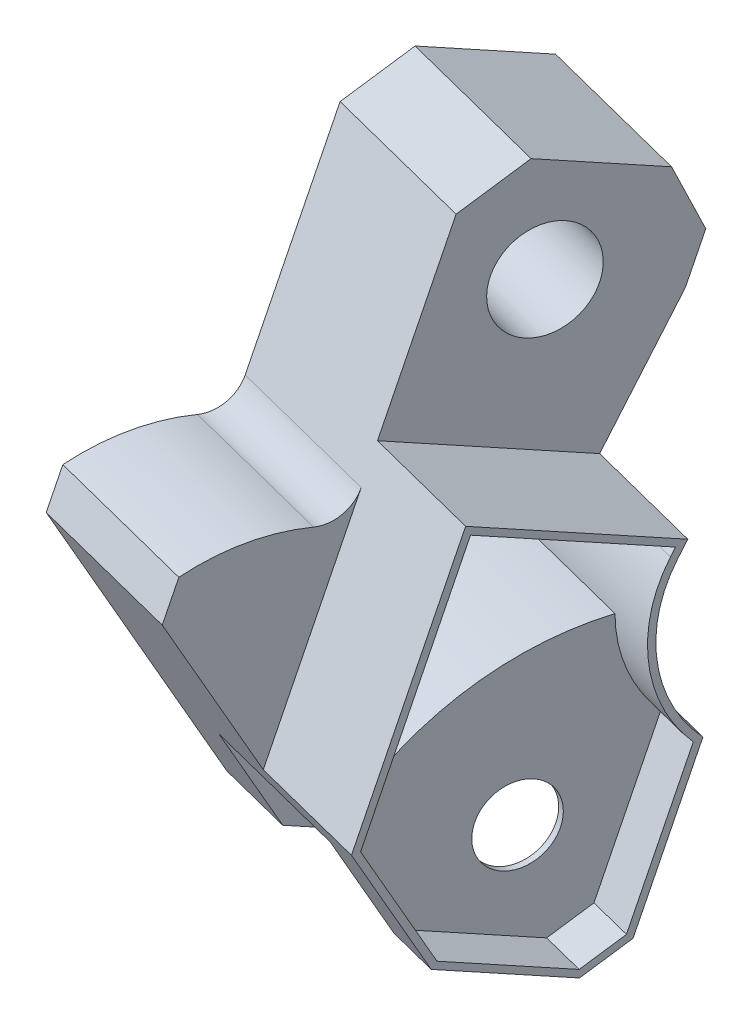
ISO-10303-21;
HEADER;
FILE_DESCRIPTION(('STEP AP214'),'2;1');
FILE_NAME('part.step','',(''),(''),'','','');
FILE_SCHEMA(('AUTOMOTIVE_DESIGN { 1 0 10303 214 1 1 1 1 }'));
ENDSEC;
DATA;
#1=APPLICATION_CONTEXT('core data for automotive mechanical design processes');
#2=APPLICATION_PROTOCOL_DEFINITION('international standard','automotive_design',2000,#1);
#3=PRODUCT_CONTEXT('',#1,'mechanical');
#4=PRODUCT('Part','Part','',(#3));
#5=PRODUCT_RELATED_PRODUCT_CATEGORY('part','',(#4));
#6=PRODUCT_DEFINITION_FORMATION('','',#4);
#7=PRODUCT_DEFINITION_CONTEXT('part definition',#1,'design');
#8=PRODUCT_DEFINITION('design','',#6,#7);
#9=PRODUCT_DEFINITION_SHAPE('','',#8);
#10=(LENGTH_UNIT() NAMED_UNIT(*) SI_UNIT(.MILLI.,.METRE.));
#11=(NAMED_UNIT(*) PLANE_ANGLE_UNIT() SI_UNIT($,.RADIAN.));
#12=(NAMED_UNIT(*) SI_UNIT($,.STERADIAN.) SOLID_ANGLE_UNIT());
#13=UNCERTAINTY_MEASURE_WITH_UNIT(LENGTH_MEASURE(1.E-05),#10,'distance_accuracy_value','');
#14=(GEOMETRIC_REPRESENTATION_CONTEXT(3) GLOBAL_UNCERTAINTY_ASSIGNED_CONTEXT((#13)) GLOBAL_UNIT_ASSIGNED_CONTEXT((#10,
#11,#12)) REPRESENTATION_CONTEXT('',''));
#15=CARTESIAN_POINT('',(0.,0.,0.));
#16=DIRECTION('',(0.,0.,1.));
#17=DIRECTION('',(1.,0.,0.));
#18=AXIS2_PLACEMENT_3D('',#15,#16,#17);
#19=CARTESIAN_POINT('',(38.7003994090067,-81.1170854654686,36.3083672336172));
#20=DIRECTION('',(0.224295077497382,0.466720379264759,-0.855490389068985));
#21=DIRECTION('',(-0.160211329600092,0.883572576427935,0.440036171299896));
#22=AXIS2_PLACEMENT_3D('',#19,#20,#21);
#23=PLANE('',#22);
#24=DIRECTION('',(0.160211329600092,-0.883572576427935,-0.440036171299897));
#25=VECTOR('',#24,1.);
#26=CARTESIAN_POINT('',(28.4834260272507,-67.4881218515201,41.0650521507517));
#27=LINE('',#26,#25);
#28=CARTESIAN_POINT('',(28.4834260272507,-67.4881218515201,41.0650521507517));
#29=VERTEX_POINT('',#28);
#30=CARTESIAN_POINT('',(31.0103058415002,-81.4239759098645,34.1247282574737));
#31=VERTEX_POINT('',#30);
#32=EDGE_CURVE('E322',#29,#31,#27,.T.);
#33=ORIENTED_EDGE('',*,*,#32,.T.);
#34=DIRECTION('',(-0.96126169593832,-0.0383613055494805,-0.272954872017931));
#35=VECTOR('',#34,1.);
#36=CARTESIAN_POINT('',(38.7003994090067,-81.1170854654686,36.3083672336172));
#37=LINE('',#36,#35);
#38=CARTESIAN_POINT('',(38.7003994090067,-81.1170854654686,36.3083672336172));
#39=VERTEX_POINT('',#38);
#40=EDGE_CURVE('E483',#39,#31,#37,.T.);
#41=ORIENTED_EDGE('',*,*,#40,.F.);
#42=DIRECTION('',(0.160211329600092,-0.883572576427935,-0.440036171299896));
#43=VECTOR('',#42,1.);
#44=CARTESIAN_POINT('',(38.7003994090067,-81.1170854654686,36.3083672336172));
#45=LINE('',#44,#43);
#46=CARTESIAN_POINT('',(35.5417996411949,-63.6972678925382,44.9837721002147));
#47=VERTEX_POINT('',#46);
#48=EDGE_CURVE('E406',#47,#39,#45,.T.);
#49=ORIENTED_EDGE('',*,*,#48,.F.);
#50=DIRECTION('',(0.96126169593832,0.0383613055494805,0.272954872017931));
#51=VECTOR('',#50,1.);
#52=CARTESIAN_POINT('',(17.2778274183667,-64.4261326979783,39.797629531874));
#53=LINE('',#52,#51);
#54=CARTESIAN_POINT('',(17.2778274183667,-64.4261326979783,39.797629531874));
#55=VERTEX_POINT('',#54);
#56=EDGE_CURVE('E371',#55,#47,#53,.T.);
#57=ORIENTED_EDGE('',*,*,#56,.F.);
#58=DIRECTION('',(0.160211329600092,-0.883572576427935,-0.440036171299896));
#59=VECTOR('',#58,1.);
#60=CARTESIAN_POINT('',(6.18847362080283,-3.26785550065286,70.2556302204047));
#61=LINE('',#60,#59);
#62=CARTESIAN_POINT('',(13.2769343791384,-42.361030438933,50.7864756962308));
#63=VERTEX_POINT('',#62);
#64=EDGE_CURVE('E368',#63,#55,#61,.T.);
#65=ORIENTED_EDGE('',*,*,#64,.F.);
#66=DIRECTION('',(-0.96126169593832,-0.0383613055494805,-0.272954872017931));
#67=VECTOR('',#66,1.);
#68=CARTESIAN_POINT('',(31.5409066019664,-41.6321656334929,55.9726182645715));
#69=LINE('',#68,#67);
#70=CARTESIAN_POINT('',(-10.7546080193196,-43.32006307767,43.9626038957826));
#71=VERTEX_POINT('',#70);
#72=EDGE_CURVE('E486',#63,#71,#69,.T.);
#73=ORIENTED_EDGE('',*,*,#72,.T.);
#74=DIRECTION('',(0.160211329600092,-0.883572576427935,-0.440036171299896));
#75=VECTOR('',#74,1.);
#76=CARTESIAN_POINT('',(-3.59511521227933,-82.8049829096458,24.2983528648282));
#77=LINE('',#76,#75);
#78=CARTESIAN_POINT('',(-3.59511521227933,-82.8049829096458,24.2983528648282));
#79=VERTEX_POINT('',#78);
#80=EDGE_CURVE('E435',#71,#79,#77,.T.);
#81=ORIENTED_EDGE('',*,*,#80,.T.);
#82=CARTESIAN_POINT('',(7.94002513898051,-82.344647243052,27.5738113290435));
#83=VERTEX_POINT('',#82);
#84=EDGE_CURVE('E482',#83,#79,#37,.T.);
#85=ORIENTED_EDGE('',*,*,#84,.F.);
#86=DIRECTION('',(0.160211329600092,-0.883572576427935,-0.440036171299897));
#87=VECTOR('',#86,1.);
#88=CARTESIAN_POINT('',(5.413145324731,-68.4087931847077,34.5141352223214));
#89=LINE('',#88,#87);
#90=CARTESIAN_POINT('',(5.413145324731,-68.4087931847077,34.5141352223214));
#91=VERTEX_POINT('',#90);
#92=EDGE_CURVE('E342',#91,#83,#89,.T.);
#93=ORIENTED_EDGE('',*,*,#92,.F.);
#94=DIRECTION('',(-0.96126169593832,-0.0383613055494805,-0.272954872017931));
#95=VECTOR('',#94,1.);
#96=CARTESIAN_POINT('',(28.4834260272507,-67.4881218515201,41.0650521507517));
#97=LINE('',#96,#95);
#98=EDGE_CURVE('E353',#29,#91,#97,.T.);
#99=ORIENTED_EDGE('',*,*,#98,.F.);
#100=EDGE_LOOP('',(#33,#41,#49,#57,#65,#73,#81,#85,#93,#99));
#101=FACE_BOUND('',#100,.T.);
#102=ADVANCED_FACE('F17',(#101),#23,.F.);
#103=CARTESIAN_POINT('',(43.7819446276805,-88.1352182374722,19.3990884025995));
#104=DIRECTION('',(0.0666827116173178,0.928488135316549,-0.365326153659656));
#105=DIRECTION('',(0.96126169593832,0.0383613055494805,0.272954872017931));
#106=AXIS2_PLACEMENT_3D('',#103,#104,#105);
#107=PLANE('',#106);
#108=DIRECTION('',(0.26744974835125,-0.369375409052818,-0.889962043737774));
#109=VECTOR('',#108,1.);
#110=CARTESIAN_POINT('',(36.091851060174,-88.442108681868,17.2154494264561));
#111=LINE('',#110,#109);
#112=CARTESIAN_POINT('',(36.091851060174,-88.442108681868,17.2154494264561));
#113=VERTEX_POINT('',#112);
#114=EDGE_CURVE('E326',#31,#113,#111,.T.);
#115=ORIENTED_EDGE('',*,*,#114,.T.);
#116=DIRECTION('',(-0.96126169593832,-0.0383613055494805,-0.272954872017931));
#117=VECTOR('',#116,1.);
#118=CARTESIAN_POINT('',(43.7819446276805,-88.1352182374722,19.3990884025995));
#119=LINE('',#118,#117);
#120=CARTESIAN_POINT('',(43.7819446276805,-88.1352182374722,19.3990884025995));
#121=VERTEX_POINT('',#120);
#122=EDGE_CURVE('E479',#121,#113,#119,.T.);
#123=ORIENTED_EDGE('',*,*,#122,.F.);
#124=DIRECTION('',(0.26744974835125,-0.369375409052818,-0.889962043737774));
#125=VECTOR('',#124,1.);
#126=CARTESIAN_POINT('',(43.7819446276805,-88.1352182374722,19.3990884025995));
#127=LINE('',#126,#125);
#128=EDGE_CURVE('E409',#39,#121,#127,.T.);
#129=ORIENTED_EDGE('',*,*,#128,.F.);
#130=ORIENTED_EDGE('',*,*,#40,.T.);
#131=EDGE_LOOP('',(#115,#123,#129,#130));
#132=FACE_BOUND('',#131,.T.);
#133=ADVANCED_FACE('F525',(#132),#107,.F.);
#134=CARTESIAN_POINT('',(45.4526069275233,-85.3396546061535,13.1226474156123));
#135=DIRECTION('',(-0.141963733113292,0.917728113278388,0.370973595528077));
#136=DIRECTION('',(-0.236267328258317,-0.395352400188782,0.887622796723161));
#137=AXIS2_PLACEMENT_3D('',#134,#135,#136);
#138=PLANE('',#137);
#139=DIRECTION('',(0.236267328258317,0.395352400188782,-0.887622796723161));
#140=VECTOR('',#139,1.);
#141=CARTESIAN_POINT('',(36.091851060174,-88.442108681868,17.2154494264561));
#142=LINE('',#141,#140);
#143=CARTESIAN_POINT('',(37.7625133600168,-85.6465450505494,10.9390084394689));
#144=VERTEX_POINT('',#143);
#145=EDGE_CURVE('E329',#113,#144,#142,.T.);
#146=ORIENTED_EDGE('',*,*,#145,.T.);
#147=DIRECTION('',(-0.96126169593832,-0.0383613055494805,-0.272954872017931));
#148=VECTOR('',#147,1.);
#149=CARTESIAN_POINT('',(45.4526069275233,-85.3396546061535,13.1226474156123));
#150=LINE('',#149,#148);
#151=CARTESIAN_POINT('',(45.4526069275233,-85.3396546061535,13.1226474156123));
#152=VERTEX_POINT('',#151);
#153=EDGE_CURVE('E475',#152,#144,#150,.T.);
#154=ORIENTED_EDGE('',*,*,#153,.F.);
#155=DIRECTION('',(0.236267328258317,0.395352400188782,-0.887622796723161));
#156=VECTOR('',#155,1.);
#157=CARTESIAN_POINT('',(45.4526069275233,-85.3396546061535,13.1226474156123));
#158=LINE('',#157,#156);
#159=EDGE_CURVE('E411',#121,#152,#158,.T.);
#160=ORIENTED_EDGE('',*,*,#159,.F.);
#161=ORIENTED_EDGE('',*,*,#122,.T.);
#162=EDGE_LOOP('',(#146,#154,#160,#161));
#163=FACE_BOUND('',#162,.T.);
#164=ADVANCED_FACE('F532',(#163),#138,.F.);
#165=CARTESIAN_POINT('',(45.4526069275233,-85.3396546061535,13.1226474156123));
#166=DIRECTION('',(-0.26744974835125,0.369375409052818,0.889962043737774));
#167=DIRECTION('',(-0.0666827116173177,-0.928488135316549,0.365326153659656));
#168=AXIS2_PLACEMENT_3D('',#165,#166,#167);
#169=PLANE('',#168);
#170=DIRECTION('',(0.0666827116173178,0.928488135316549,-0.365326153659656));
#171=VECTOR('',#170,1.);
#172=CARTESIAN_POINT('',(39.3628984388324,-63.3628298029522,2.17118075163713));
#173=LINE('',#172,#171);
#174=CARTESIAN_POINT('',(39.3628984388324,-63.3628298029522,2.17118075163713));
#175=VERTEX_POINT('',#174);
#176=EDGE_CURVE('E332',#144,#175,#173,.T.);
#177=ORIENTED_EDGE('',*,*,#176,.T.);
#178=DIRECTION('',(-0.96126169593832,-0.0383613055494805,-0.272954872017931));
#179=VECTOR('',#178,1.);
#180=CARTESIAN_POINT('',(47.052992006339,-63.0559393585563,4.35481972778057));
#181=LINE('',#180,#179);
#182=CARTESIAN_POINT('',(47.052992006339,-63.0559393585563,4.35481972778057));
#183=VERTEX_POINT('',#182);
#184=EDGE_CURVE('E471',#183,#175,#181,.T.);
#185=ORIENTED_EDGE('',*,*,#184,.F.);
#186=DIRECTION('',(0.0666827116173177,0.928488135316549,-0.365326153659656));
#187=VECTOR('',#186,1.);
#188=CARTESIAN_POINT('',(45.4526069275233,-85.3396546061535,13.1226474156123));
#189=LINE('',#188,#187);
#190=EDGE_CURVE('E413',#152,#183,#189,.T.);
#191=ORIENTED_EDGE('',*,*,#190,.F.);
#192=ORIENTED_EDGE('',*,*,#153,.T.);
#193=EDGE_LOOP('',(#177,#185,#191,#192));
#194=FACE_BOUND('',#193,.T.);
#195=ADVANCED_FACE('F515',(#194),#169,.F.);
#196=CARTESIAN_POINT('',(50.2868891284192,-49.8260694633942,-8.89329153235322));
#197=DIRECTION('',(-0.96126169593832,-0.0383613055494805,-0.272954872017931));
#198=DIRECTION('',(0.0666827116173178,0.928488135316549,-0.365326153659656));
#199=AXIS2_PLACEMENT_3D('',#196,#197,#198);
#200=CYLINDRICAL_SURFACE('',#199,19.);
#201=CARTESIAN_POINT('',(42.5967955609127,-50.1329599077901,-11.0769305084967));
#202=DIRECTION('',(-0.96126169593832,-0.0383613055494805,-0.272954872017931));
#203=DIRECTION('',(-0.0666827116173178,-0.928488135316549,0.365326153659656));
#204=AXIS2_PLACEMENT_3D('',#201,#202,#203);
#205=CIRCLE('',#204,19.);
#206=CARTESIAN_POINT('',(37.4315100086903,-50.7313610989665,7.19768962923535));
#207=VERTEX_POINT('',#206);
#208=EDGE_CURVE('E335',#175,#207,#205,.T.);
#209=ORIENTED_EDGE('',*,*,#208,.T.);
#210=DIRECTION('',(-0.96126169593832,-0.0383613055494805,-0.272954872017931));
#211=VECTOR('',#210,1.);
#212=CARTESIAN_POINT('',(37.4315100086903,-50.7313610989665,7.19768962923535));
#213=LINE('',#212,#211);
#214=CARTESIAN_POINT('',(14.3612293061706,-51.6520324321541,0.646772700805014));
#215=VERTEX_POINT('',#214);
#216=EDGE_CURVE('E338',#207,#215,#213,.T.);
#217=ORIENTED_EDGE('',*,*,#216,.T.);
#218=CARTESIAN_POINT('',(19.526514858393,-51.0536312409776,-17.627847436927));
#219=DIRECTION('',(-0.96126169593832,-0.0383613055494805,-0.272954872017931));
#220=DIRECTION('',(-0.0666827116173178,-0.928488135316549,0.365326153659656));
#221=AXIS2_PLACEMENT_3D('',#218,#219,#220);
#222=CIRCLE('',#221,19.);
#223=CARTESIAN_POINT('',(16.2926177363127,-64.2835011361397,-4.3797361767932));
#224=VERTEX_POINT('',#223);
#225=EDGE_CURVE('E323',#224,#215,#222,.T.);
#226=ORIENTED_EDGE('',*,*,#225,.F.);
#227=CARTESIAN_POINT('',(4.7574773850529,-64.7438368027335,-7.65519464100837));
#228=VERTEX_POINT('',#227);
#229=EDGE_CURVE('E470',#224,#228,#181,.T.);
#230=ORIENTED_EDGE('',*,*,#229,.T.);
#231=CARTESIAN_POINT('',(7.99137450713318,-51.5139669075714,-20.9033059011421));
#232=DIRECTION('',(-0.96126169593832,-0.0383613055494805,-0.272954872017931));
#233=DIRECTION('',(0.0666827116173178,0.928488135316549,-0.365326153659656));
#234=AXIS2_PLACEMENT_3D('',#231,#232,#233);
#235=CIRCLE('',#234,19.);
#236=CARTESIAN_POINT('',(3.20703667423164,-41.5390801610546,-5.45624320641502));
#237=VERTEX_POINT('',#236);
#238=EDGE_CURVE('E447',#228,#237,#235,.T.);
#239=ORIENTED_EDGE('',*,*,#238,.T.);
#240=DIRECTION('',(-0.96126169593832,-0.0383613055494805,-0.272954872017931));
#241=VECTOR('',#240,1.);
#242=CARTESIAN_POINT('',(45.5025512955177,-39.8511827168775,6.55377116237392));
#243=LINE('',#242,#241);
#244=CARTESIAN_POINT('',(45.5025512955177,-39.8511827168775,6.55377116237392));
#245=VERTEX_POINT('',#244);
#246=EDGE_CURVE('E467',#245,#237,#243,.T.);
#247=ORIENTED_EDGE('',*,*,#246,.F.);
#248=CARTESIAN_POINT('',(50.2868891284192,-49.8260694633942,-8.89329153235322));
#249=DIRECTION('',(-0.96126169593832,-0.0383613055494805,-0.272954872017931));
#250=DIRECTION('',(0.0666827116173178,0.928488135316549,-0.365326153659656));
#251=AXIS2_PLACEMENT_3D('',#248,#249,#250);
#252=CIRCLE('',#251,19.);
#253=EDGE_CURVE('E415',#183,#245,#252,.T.);
#254=ORIENTED_EDGE('',*,*,#253,.F.);
#255=ORIENTED_EDGE('',*,*,#184,.T.);
#256=EDGE_LOOP('',(#209,#217,#226,#230,#239,#247,#254,#255));
#257=FACE_BOUND('',#256,.T.);
#258=ADVANCED_FACE('F502',(#257),#200,.F.);
#259=CARTESIAN_POINT('',(0.0129402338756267,-73.4999031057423,10.2841662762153));
#260=DIRECTION('',(0.96126169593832,0.0383613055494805,0.272954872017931));
#261=DIRECTION('',(-0.0666827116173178,-0.928488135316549,0.365326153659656));
#262=AXIS2_PLACEMENT_3D('',#259,#260,#261);
#263=CYLINDRICAL_SURFACE('',#262,5.5);
#264=CARTESIAN_POINT('',(35.5796229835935,-72.0805348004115,20.3834965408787));
#265=DIRECTION('',(-0.96126169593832,-0.0383613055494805,-0.272954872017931));
#266=DIRECTION('',(0.0666827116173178,0.928488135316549,-0.365326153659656));
#267=AXIS2_PLACEMENT_3D('',#264,#265,#266);
#268=CIRCLE('',#267,5.5);
#269=CARTESIAN_POINT('',(35.9463778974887,-66.9738500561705,18.3742026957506));
#270=VERTEX_POINT('',#269);
#271=EDGE_CURVE('E21',#270,#270,#268,.F.);
#272=ORIENTED_EDGE('',*,*,#271,.T.);
#273=EDGE_LOOP('',(#272));
#274=FACE_BOUND('',#273,.T.);
#275=CARTESIAN_POINT('',(34.6183612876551,-72.118896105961,20.1105416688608));
#276=DIRECTION('',(-0.96126169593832,-0.0383613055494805,-0.272954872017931));
#277=DIRECTION('',(0.0666827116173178,0.928488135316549,-0.365326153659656));
#278=AXIS2_PLACEMENT_3D('',#275,#276,#277);
#279=CIRCLE('',#278,5.5);
#280=CARTESIAN_POINT('',(34.9851162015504,-67.01221136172,18.1012478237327));
#281=VERTEX_POINT('',#280);
#282=EDGE_CURVE('E360',#281,#281,#279,.F.);
#283=ORIENTED_EDGE('',*,*,#282,.F.);
#284=EDGE_LOOP('',(#283));
#285=FACE_BOUND('',#284,.T.);
#286=ADVANCED_FACE('F499',(#274,#285),#263,.F.);
#287=CARTESIAN_POINT('',(36.4471133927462,-30.6250159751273,37.1475383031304));
#288=DIRECTION('',(-0.96126169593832,-0.0383613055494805,-0.272954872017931));
#289=DIRECTION('',(0.0666827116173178,0.928488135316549,-0.365326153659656));
#290=AXIS2_PLACEMENT_3D('',#287,#288,#289);
#291=PLANE('',#290);
#292=DIRECTION('',(-0.26744974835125,0.369375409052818,0.889962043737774));
#293=VECTOR('',#292,1.);
#294=CARTESIAN_POINT('',(45.3859570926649,-38.3007510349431,6.74648051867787));
#295=LINE('',#294,#293);
#296=CARTESIAN_POINT('',(45.3859570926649,-38.3007510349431,6.74648051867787));
#297=VERTEX_POINT('',#296);
#298=CARTESIAN_POINT('',(38.3569212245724,-28.5929348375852,30.1362020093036));
#299=VERTEX_POINT('',#298);
#300=EDGE_CURVE('E287',#297,#299,#295,.T.);
#301=ORIENTED_EDGE('',*,*,#300,.F.);
#302=DIRECTION('',(0.112111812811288,0.850240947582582,-0.514316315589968));
#303=VECTOR('',#302,1.);
#304=CARTESIAN_POINT('',(45.2507440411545,-39.3261886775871,7.3667744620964));
#305=LINE('',#304,#303);
#306=CARTESIAN_POINT('',(45.2507440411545,-39.3261886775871,7.3667744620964));
#307=VERTEX_POINT('',#306);
#308=EDGE_CURVE('E242',#307,#297,#305,.T.);
#309=ORIENTED_EDGE('',*,*,#308,.F.);
#310=CARTESIAN_POINT('',(50.2868891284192,-49.8260694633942,-8.89329153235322));
#311=DIRECTION('',(-0.96126169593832,-0.0383613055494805,-0.272954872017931));
#312=DIRECTION('',(-0.0666827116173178,-0.928488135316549,0.365326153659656));
#313=AXIS2_PLACEMENT_3D('',#310,#311,#312);
#314=CIRCLE('',#313,20.);
#315=CARTESIAN_POINT('',(46.7431264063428,-63.2771610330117,5.47716014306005));
#316=VERTEX_POINT('',#315);
#317=EDGE_CURVE('E263',#316,#307,#314,.T.);
#318=ORIENTED_EDGE('',*,*,#317,.F.);
#319=DIRECTION('',(0.0666827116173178,0.928488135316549,-0.365326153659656));
#320=VECTOR('',#319,1.);
#321=CARTESIAN_POINT('',(45.2127780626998,-84.5856868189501,13.8612864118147));
#322=LINE('',#321,#320);
#323=CARTESIAN_POINT('',(45.2127780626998,-84.5856868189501,13.8612864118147));
#324=VERTEX_POINT('',#323);
#325=EDGE_CURVE('E42',#324,#316,#322,.T.);
#326=ORIENTED_EDGE('',*,*,#325,.F.);
#327=DIRECTION('',(0.236267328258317,0.395352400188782,-0.887622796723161));
#328=VECTOR('',#327,1.);
#329=CARTESIAN_POINT('',(43.7378460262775,-87.0537297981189,19.4023965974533));
#330=LINE('',#329,#328);
#331=CARTESIAN_POINT('',(43.7378460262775,-87.0537297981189,19.4023965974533));
#332=VERTEX_POINT('',#331);
#333=EDGE_CURVE('E275',#332,#324,#330,.T.);
#334=ORIENTED_EDGE('',*,*,#333,.F.);
#335=DIRECTION('',(0.26744974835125,-0.369375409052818,-0.889962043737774));
#336=VECTOR('',#335,1.);
#337=CARTESIAN_POINT('',(38.865649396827,-80.3247288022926,35.6150499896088));
#338=LINE('',#337,#336);
#339=CARTESIAN_POINT('',(38.865649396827,-80.3247288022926,35.6150499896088));
#340=VERTEX_POINT('',#339);
#341=EDGE_CURVE('E278',#340,#332,#338,.T.);
#342=ORIENTED_EDGE('',*,*,#341,.F.);
#343=DIRECTION('',(0.160211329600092,-0.883572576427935,-0.440036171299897));
#344=VECTOR('',#343,1.);
#345=CARTESIAN_POINT('',(35.8400171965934,-63.6382332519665,43.925246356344));
#346=LINE('',#345,#344);
#347=CARTESIAN_POINT('',(35.8400171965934,-63.6382332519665,43.925246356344));
#348=VERTEX_POINT('',#347);
#349=EDGE_CURVE('E281',#348,#340,#346,.T.);
#350=ORIENTED_EDGE('',*,*,#349,.F.);
#351=DIRECTION('',(-0.0666827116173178,-0.928488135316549,0.365326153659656));
#352=VECTOR('',#351,1.);
#353=CARTESIAN_POINT('',(38.3569212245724,-28.5929348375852,30.1362020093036));
#354=LINE('',#353,#352);
#355=EDGE_CURVE('E284',#299,#348,#354,.T.);
#356=ORIENTED_EDGE('',*,*,#355,.F.);
#357=EDGE_LOOP('',(#301,#309,#318,#326,#334,#342,#350,#356));
#358=FACE_BOUND('',#357,.T.);
#359=DIRECTION('',(-0.0666827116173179,-0.928488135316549,0.365326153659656));
#360=VECTOR('',#359,1.);
#361=CARTESIAN_POINT('',(39.9565874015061,-2.2258916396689,20.7970317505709));
#362=LINE('',#361,#360);
#363=CARTESIAN_POINT('',(38.1561541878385,-27.2950712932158,30.6608378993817));
#364=VERTEX_POINT('',#363);
#365=EDGE_CURVE('E404',#364,#47,#362,.T.);
#366=ORIENTED_EDGE('',*,*,#365,.T.);
#367=ORIENTED_EDGE('',*,*,#48,.T.);
#368=ORIENTED_EDGE('',*,*,#128,.T.);
#369=ORIENTED_EDGE('',*,*,#159,.T.);
#370=ORIENTED_EDGE('',*,*,#190,.T.);
#371=ORIENTED_EDGE('',*,*,#253,.T.);
#372=DIRECTION('',(0.112111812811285,0.850240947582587,-0.51431631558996));
#373=VECTOR('',#372,1.);
#374=CARTESIAN_POINT('',(48.0482003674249,-20.545321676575,-5.12447057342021));
#375=LINE('',#374,#373);
#376=CARTESIAN_POINT('',(45.7713740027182,-37.8124673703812,5.32053890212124));
#377=VERTEX_POINT('',#376);
#378=EDGE_CURVE('E417',#245,#377,#375,.T.);
#379=ORIENTED_EDGE('',*,*,#378,.T.);
#380=DIRECTION('',(0.26744974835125,-0.369375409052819,-0.889962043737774));
#381=VECTOR('',#380,1.);
#382=CARTESIAN_POINT('',(19.9828035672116,-2.19581858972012,91.1342253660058));
#383=LINE('',#382,#381);
#384=EDGE_CURVE('E374',#364,#377,#383,.T.);
#385=ORIENTED_EDGE('',*,*,#384,.F.);
#386=EDGE_LOOP('',(#366,#367,#368,#369,#370,#371,#379,#385));
#387=FACE_BOUND('',#386,.T.);
#388=ADVANCED_FACE('F501',(#358,#387),#291,.F.);
#389=CARTESIAN_POINT('',(36.4471133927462,-30.6250159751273,37.1475383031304));
#390=DIRECTION('',(-0.96126169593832,-0.0383613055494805,-0.272954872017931));
#391=DIRECTION('',(0.0666827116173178,0.928488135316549,-0.365326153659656));
#392=AXIS2_PLACEMENT_3D('',#389,#390,#391);
#393=CYLINDRICAL_SURFACE('',#392,5.);
#394=CARTESIAN_POINT('',(18.1831411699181,-31.3538807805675,31.9613957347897));
#395=DIRECTION('',(0.96126169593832,0.0383613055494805,0.272954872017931));
#396=DIRECTION('',(-0.0666827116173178,-0.928488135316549,0.365326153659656));
#397=AXIS2_PLACEMENT_3D('',#394,#395,#396);
#398=CIRCLE('',#397,5.);
#399=CARTESIAN_POINT('',(19.5203899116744,-33.2007578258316,27.5115855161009));
#400=VERTEX_POINT('',#399);
#401=CARTESIAN_POINT('',(18.0500067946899,-36.2174472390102,33.1137830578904));
#402=VERTEX_POINT('',#401);
#403=EDGE_CURVE('E362',#400,#402,#398,.F.);
#404=ORIENTED_EDGE('',*,*,#403,.F.);
#405=DIRECTION('',(-0.96126169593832,-0.0383613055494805,-0.272954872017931));
#406=VECTOR('',#405,1.);
#407=CARTESIAN_POINT('',(37.7843621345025,-32.4718930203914,32.6977280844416));
#408=LINE('',#407,#406);
#409=CARTESIAN_POINT('',(-4.51115248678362,-34.1597904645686,20.6877137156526));
#410=VERTEX_POINT('',#409);
#411=EDGE_CURVE('E26',#400,#410,#408,.T.);
#412=ORIENTED_EDGE('',*,*,#411,.T.);
#413=CARTESIAN_POINT('',(-5.84840122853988,-32.3129134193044,25.1375239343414));
#414=DIRECTION('',(-0.96126169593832,-0.0383613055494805,-0.272954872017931));
#415=DIRECTION('',(0.0666827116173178,0.928488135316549,-0.365326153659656));
#416=AXIS2_PLACEMENT_3D('',#413,#414,#415);
#417=CIRCLE('',#416,5.);
#418=CARTESIAN_POINT('',(-5.98153560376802,-37.1764798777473,26.2899112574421));
#419=VERTEX_POINT('',#418);
#420=EDGE_CURVE('E426',#410,#419,#417,.T.);
#421=ORIENTED_EDGE('',*,*,#420,.T.);
#422=DIRECTION('',(-0.96126169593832,-0.0383613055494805,-0.272954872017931));
#423=VECTOR('',#422,1.);
#424=CARTESIAN_POINT('',(36.3139790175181,-35.4885824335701,38.2999256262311));
#425=LINE('',#424,#423);
#426=EDGE_CURVE('E490',#402,#419,#425,.T.);
#427=ORIENTED_EDGE('',*,*,#426,.F.);
#428=EDGE_LOOP('',(#404,#412,#421,#427));
#429=FACE_BOUND('',#428,.T.);
#430=ADVANCED_FACE('F512',(#429),#393,.F.);
#431=CARTESIAN_POINT('',(35.5417996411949,-63.6972678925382,44.9837721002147));
#432=DIRECTION('',(-0.96126169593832,-0.0383613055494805,-0.272954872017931));
#433=DIRECTION('',(0.0666827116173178,0.928488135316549,-0.365326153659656));
#434=AXIS2_PLACEMENT_3D('',#431,#432,#433);
#435=CYLINDRICAL_SURFACE('',#434,29.);
#436=CARTESIAN_POINT('',(17.2778274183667,-64.4261326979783,39.797629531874));
#437=DIRECTION('',(0.96126169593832,0.0383613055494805,0.272954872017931));
#438=DIRECTION('',(-0.0666827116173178,-0.928488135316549,0.365326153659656));
#439=AXIS2_PLACEMENT_3D('',#436,#437,#438);
#440=CIRCLE('',#439,29.);
#441=CARTESIAN_POINT('',(13.6572272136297,-37.0658440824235,48.703013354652));
#442=VERTEX_POINT('',#441);
#443=EDGE_CURVE('E364',#402,#442,#440,.T.);
#444=ORIENTED_EDGE('',*,*,#443,.F.);
#445=ORIENTED_EDGE('',*,*,#426,.T.);
#446=CARTESIAN_POINT('',(-6.75371498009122,-65.3851653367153,32.9737577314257));
#447=DIRECTION('',(0.96126169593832,0.0383613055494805,0.272954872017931));
#448=DIRECTION('',(0.0666827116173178,0.928488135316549,-0.365326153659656));
#449=AXIS2_PLACEMENT_3D('',#446,#447,#448);
#450=CIRCLE('',#449,29.);
#451=CARTESIAN_POINT('',(-10.3743151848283,-38.0248767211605,41.8791415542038));
#452=VERTEX_POINT('',#451);
#453=EDGE_CURVE('E429',#419,#452,#450,.T.);
#454=ORIENTED_EDGE('',*,*,#453,.T.);
#455=DIRECTION('',(-0.96126169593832,-0.0383613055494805,-0.272954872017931));
#456=VECTOR('',#455,1.);
#457=CARTESIAN_POINT('',(31.9211994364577,-36.3369792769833,53.8891559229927));
#458=LINE('',#457,#456);
#459=EDGE_CURVE('E488',#442,#452,#458,.T.);
#460=ORIENTED_EDGE('',*,*,#459,.F.);
#461=EDGE_LOOP('',(#444,#445,#454,#460));
#462=FACE_BOUND('',#461,.T.);
#463=ADVANCED_FACE('F541',(#462),#435,.T.);
#464=CARTESIAN_POINT('',(31.5409066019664,-41.6321656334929,55.9726182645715));
#465=DIRECTION('',(0.26744974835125,-0.369375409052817,-0.889962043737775));
#466=DIRECTION('',(0.0666827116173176,0.92848813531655,-0.365326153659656));
#467=AXIS2_PLACEMENT_3D('',#464,#465,#466);
#468=PLANE('',#467);
#469=DIRECTION('',(-0.0666827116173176,-0.92848813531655,0.365326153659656));
#470=VECTOR('',#469,1.);
#471=CARTESIAN_POINT('',(13.996346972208,-32.3439504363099,46.8451207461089));
#472=LINE('',#471,#470);
#473=EDGE_CURVE('E366',#442,#63,#472,.T.);
#474=ORIENTED_EDGE('',*,*,#473,.F.);
#475=ORIENTED_EDGE('',*,*,#459,.T.);
#476=DIRECTION('',(-0.0666827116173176,-0.928488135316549,0.365326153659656));
#477=VECTOR('',#476,1.);
#478=CARTESIAN_POINT('',(-10.7546080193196,-43.32006307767,43.9626038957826));
#479=LINE('',#478,#477);
#480=EDGE_CURVE('E432',#452,#71,#479,.T.);
#481=ORIENTED_EDGE('',*,*,#480,.T.);
#482=ORIENTED_EDGE('',*,*,#72,.F.);
#483=EDGE_LOOP('',(#474,#475,#481,#482));
#484=FACE_BOUND('',#483,.T.);
#485=ADVANCED_FACE('F538',(#484),#468,.F.);
#486=CARTESIAN_POINT('',(42.2955146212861,1.68789744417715,12.0100143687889));
#487=DIRECTION('',(0.141963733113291,-0.917728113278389,-0.370973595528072));
#488=DIRECTION('',(0.236267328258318,0.395352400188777,-0.887622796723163));
#489=AXIS2_PLACEMENT_3D('',#486,#487,#488);
#490=PLANE('',#489);
#491=DIRECTION('',(-0.236267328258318,-0.395352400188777,0.887622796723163));
#492=VECTOR('',#491,1.);
#493=CARTESIAN_POINT('',(3.78947521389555,-32.9125564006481,82.8704433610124));
#494=LINE('',#493,#492);
#495=CARTESIAN_POINT('',(24.031542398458,0.959032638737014,6.82387180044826));
#496=VERTEX_POINT('',#495);
#497=CARTESIAN_POINT('',(21.692615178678,-2.95475644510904,15.6108891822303));
#498=VERTEX_POINT('',#497);
#499=EDGE_CURVE('E392',#496,#498,#494,.T.);
#500=ORIENTED_EDGE('',*,*,#499,.F.);
#501=DIRECTION('',(-0.96126169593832,-0.0383613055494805,-0.272954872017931));
#502=VECTOR('',#501,1.);
#503=CARTESIAN_POINT('',(42.2955146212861,1.68789744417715,12.0100143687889));
#504=LINE('',#503,#502);
#505=CARTESIAN_POINT('',(0.,0.,0.));
#506=VERTEX_POINT('',#505);
#507=EDGE_CURVE('E420',#496,#506,#504,.T.);
#508=ORIENTED_EDGE('',*,*,#507,.T.);
#509=DIRECTION('',(-0.236267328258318,-0.395352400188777,0.887622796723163));
#510=VECTOR('',#509,1.);
#511=CARTESIAN_POINT('',(0.,0.,0.));
#512=LINE('',#511,#510);
#513=CARTESIAN_POINT('',(-2.33892721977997,-3.91378908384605,8.78701738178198));
#514=VERTEX_POINT('',#513);
#515=EDGE_CURVE('E403',#506,#514,#512,.T.);
#516=ORIENTED_EDGE('',*,*,#515,.T.);
#517=DIRECTION('',(-0.96126169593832,-0.0383613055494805,-0.272954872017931));
#518=VECTOR('',#517,1.);
#519=CARTESIAN_POINT('',(39.9565874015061,-2.2258916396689,20.7970317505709));
#520=LINE('',#519,#518);
#521=EDGE_CURVE('E10',#498,#514,#520,.T.);
#522=ORIENTED_EDGE('',*,*,#521,.F.);
#523=EDGE_LOOP('',(#500,#508,#516,#522));
#524=FACE_BOUND('',#523,.T.);
#525=ADVANCED_FACE('F19',(#524),#490,.F.);
#526=CARTESIAN_POINT('',(48.5149793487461,-14.0459047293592,-7.6817536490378));
#527=DIRECTION('',(-0.26744974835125,0.369375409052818,0.889962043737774));
#528=DIRECTION('',(-0.96126169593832,-0.0383613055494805,-0.272954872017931));
#529=AXIS2_PLACEMENT_3D('',#526,#527,#528);
#530=PLANE('',#529);
#531=DIRECTION('',(0.0666827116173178,0.928488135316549,-0.365326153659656));
#532=VECTOR('',#531,1.);
#533=CARTESIAN_POINT('',(27.6362841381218,-51.1820962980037,1.45705651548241));
#534=LINE('',#533,#532);
#535=CARTESIAN_POINT('',(29.7842281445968,-21.2741864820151,-10.3106131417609));
#536=VERTEX_POINT('',#535);
#537=CARTESIAN_POINT('',(30.251007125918,-14.7747695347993,-12.8678962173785));
#538=VERTEX_POINT('',#537);
#539=EDGE_CURVE('E386',#536,#538,#534,.T.);
#540=ORIENTED_EDGE('',*,*,#539,.F.);
#541=DIRECTION('',(-0.96126169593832,-0.0383613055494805,-0.272954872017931));
#542=VECTOR('',#541,1.);
#543=CARTESIAN_POINT('',(48.0482003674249,-20.545321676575,-5.12447057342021));
#544=LINE('',#543,#542);
#545=CARTESIAN_POINT('',(5.75268574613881,-22.2332191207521,-17.1344849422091));
#546=VERTEX_POINT('',#545);
#547=EDGE_CURVE('E465',#536,#546,#544,.T.);
#548=ORIENTED_EDGE('',*,*,#547,.T.);
#549=DIRECTION('',(0.0666827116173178,0.928488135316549,-0.365326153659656));
#550=VECTOR('',#549,1.);
#551=CARTESIAN_POINT('',(6.21946472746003,-15.7338021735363,-19.6917680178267));
#552=LINE('',#551,#550);
#553=CARTESIAN_POINT('',(6.21946472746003,-15.7338021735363,-19.6917680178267));
#554=VERTEX_POINT('',#553);
#555=EDGE_CURVE('E452',#546,#554,#552,.T.);
#556=ORIENTED_EDGE('',*,*,#555,.T.);
#557=DIRECTION('',(-0.96126169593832,-0.0383613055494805,-0.272954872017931));
#558=VECTOR('',#557,1.);
#559=CARTESIAN_POINT('',(48.5149793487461,-14.0459047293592,-7.6817536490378));
#560=LINE('',#559,#558);
#561=EDGE_CURVE('E463',#538,#554,#560,.T.);
#562=ORIENTED_EDGE('',*,*,#561,.F.);
#563=EDGE_LOOP('',(#540,#548,#556,#562));
#564=FACE_BOUND('',#563,.T.);
#565=ADVANCED_FACE('F583',(#564),#530,.F.);
#566=CARTESIAN_POINT('',(47.1096100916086,-4.96085991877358,-4.00930241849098));
#567=DIRECTION('',(-0.236267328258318,-0.39535240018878,0.887622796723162));
#568=DIRECTION('',(0.141963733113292,-0.917728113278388,-0.370973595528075));
#569=AXIS2_PLACEMENT_3D('',#566,#567,#568);
#570=PLANE('',#569);
#571=DIRECTION('',(-0.141963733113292,0.917728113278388,0.370973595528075));
#572=VECTOR('',#571,1.);
#573=CARTESIAN_POINT('',(24.1538008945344,24.6407730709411,3.0650640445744));
#574=LINE('',#573,#572);
#575=CARTESIAN_POINT('',(28.8456378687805,-5.68972472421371,-9.19544498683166));
#576=VERTEX_POINT('',#575);
#577=EDGE_CURVE('E388',#538,#576,#574,.T.);
#578=ORIENTED_EDGE('',*,*,#577,.F.);
#579=ORIENTED_EDGE('',*,*,#561,.T.);
#580=DIRECTION('',(-0.141963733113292,0.917728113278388,0.370973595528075));
#581=VECTOR('',#580,1.);
#582=CARTESIAN_POINT('',(4.8140954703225,-6.64875736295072,-16.01931678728));
#583=LINE('',#582,#581);
#584=CARTESIAN_POINT('',(4.8140954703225,-6.64875736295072,-16.01931678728));
#585=VERTEX_POINT('',#584);
#586=EDGE_CURVE('E455',#554,#585,#583,.T.);
#587=ORIENTED_EDGE('',*,*,#586,.T.);
#588=DIRECTION('',(-0.96126169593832,-0.0383613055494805,-0.272954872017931));
#589=VECTOR('',#588,1.);
#590=CARTESIAN_POINT('',(47.1096100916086,-4.96085991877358,-4.00930241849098));
#591=LINE('',#590,#589);
#592=EDGE_CURVE('E461',#576,#585,#591,.T.);
#593=ORIENTED_EDGE('',*,*,#592,.F.);
#594=EDGE_LOOP('',(#578,#579,#587,#593));
#595=FACE_BOUND('',#594,.T.);
#596=ADVANCED_FACE('F587',(#595),#570,.F.);
#597=CARTESIAN_POINT('',(42.2955146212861,1.68789744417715,12.0100143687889));
#598=DIRECTION('',(-0.0666827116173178,-0.928488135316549,0.365326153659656));
#599=DIRECTION('',(-0.96126169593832,-0.0383613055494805,-0.272954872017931));
#600=AXIS2_PLACEMENT_3D('',#597,#598,#599);
#601=PLANE('',#600);
#602=DIRECTION('',(-0.26744974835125,0.369375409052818,0.889962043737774));
#603=VECTOR('',#602,1.);
#604=CARTESIAN_POINT('',(3.98604353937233,28.6439132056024,73.5269935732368));
#605=LINE('',#604,#603);
#606=EDGE_CURVE('E390',#576,#496,#605,.T.);
#607=ORIENTED_EDGE('',*,*,#606,.F.);
#608=ORIENTED_EDGE('',*,*,#592,.T.);
#609=DIRECTION('',(-0.26744974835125,0.369375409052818,0.889962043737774));
#610=VECTOR('',#609,1.);
#611=CARTESIAN_POINT('',(0.,0.,0.));
#612=LINE('',#611,#610);
#613=EDGE_CURVE('E407',#585,#506,#612,.T.);
#614=ORIENTED_EDGE('',*,*,#613,.T.);
#615=ORIENTED_EDGE('',*,*,#507,.F.);
#616=EDGE_LOOP('',(#607,#608,#614,#615));
#617=FACE_BOUND('',#616,.T.);
#618=ADVANCED_FACE('F594',(#617),#601,.F.);
#619=CARTESIAN_POINT('',(43.2341048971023,-13.8965643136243,10.8948462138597));
#620=DIRECTION('',(-0.96126169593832,-0.0383613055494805,-0.272954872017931));
#621=DIRECTION('',(0.0666827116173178,0.928488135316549,-0.365326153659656));
#622=AXIS2_PLACEMENT_3D('',#619,#620,#621);
#623=CYLINDRICAL_SURFACE('',#622,7.);
#624=CARTESIAN_POINT('',(0.938590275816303,-15.5844617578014,-1.11516815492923));
#625=DIRECTION('',(0.96126169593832,0.0383613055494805,0.272954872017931));
#626=DIRECTION('',(-0.0666827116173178,-0.928488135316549,0.365326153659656));
#627=AXIS2_PLACEMENT_3D('',#624,#625,#626);
#628=CIRCLE('',#627,7.);
#629=CARTESIAN_POINT('',(0.471811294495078,-22.0838787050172,1.44211492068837));
#630=VERTEX_POINT('',#629);
#631=EDGE_CURVE('E399',#630,#630,#628,.T.);
#632=ORIENTED_EDGE('',*,*,#631,.F.);
#633=EDGE_LOOP('',(#632));
#634=FACE_BOUND('',#633,.T.);
#635=CARTESIAN_POINT('',(24.9701326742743,-14.6254291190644,5.70870364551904));
#636=DIRECTION('',(0.96126169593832,0.0383613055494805,0.272954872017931));
#637=DIRECTION('',(-0.0666827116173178,-0.928488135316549,0.365326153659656));
#638=AXIS2_PLACEMENT_3D('',#635,#636,#637);
#639=CIRCLE('',#638,7.);
#640=CARTESIAN_POINT('',(24.5033536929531,-21.1248460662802,8.26598672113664));
#641=VERTEX_POINT('',#640);
#642=EDGE_CURVE('E375',#641,#641,#639,.F.);
#643=ORIENTED_EDGE('',*,*,#642,.F.);
#644=EDGE_LOOP('',(#643));
#645=FACE_BOUND('',#644,.T.);
#646=ADVANCED_FACE('F559',(#634,#645),#623,.F.);
#647=CARTESIAN_POINT('',(-5.84840122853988,-32.3129134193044,25.1375239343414));
#648=DIRECTION('',(-0.96126169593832,-0.0383613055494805,-0.272954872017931));
#649=DIRECTION('',(0.0666827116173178,0.928488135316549,-0.365326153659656));
#650=AXIS2_PLACEMENT_3D('',#647,#648,#649);
#651=PLANE('',#650);
#652=CARTESIAN_POINT('',(0.0129402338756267,-73.4999031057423,10.2841662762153));
#653=DIRECTION('',(0.96126169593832,0.0383613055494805,0.272954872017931));
#654=DIRECTION('',(-0.0666827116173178,-0.928488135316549,0.365326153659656));
#655=AXIS2_PLACEMENT_3D('',#652,#653,#654);
#656=CIRCLE('',#655,5.5);
#657=CARTESIAN_POINT('',(-0.353814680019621,-78.6065878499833,12.2934601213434));
#658=VERTEX_POINT('',#657);
#659=EDGE_CURVE('E356',#658,#658,#656,.T.);
#660=ORIENTED_EDGE('',*,*,#659,.T.);
#661=EDGE_LOOP('',(#660));
#662=FACE_BOUND('',#661,.T.);
#663=ORIENTED_EDGE('',*,*,#515,.F.);
#664=ORIENTED_EDGE('',*,*,#613,.F.);
#665=ORIENTED_EDGE('',*,*,#586,.F.);
#666=ORIENTED_EDGE('',*,*,#555,.F.);
#667=DIRECTION('',(0.112111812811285,0.850240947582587,-0.51431631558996));
#668=VECTOR('',#667,1.);
#669=CARTESIAN_POINT('',(5.75268574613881,-22.2332191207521,-17.1344849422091));
#670=LINE('',#669,#668);
#671=EDGE_CURVE('E449',#237,#546,#670,.T.);
#672=ORIENTED_EDGE('',*,*,#671,.F.);
#673=ORIENTED_EDGE('',*,*,#238,.F.);
#674=DIRECTION('',(0.0666827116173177,0.928488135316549,-0.365326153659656));
#675=VECTOR('',#674,1.);
#676=CARTESIAN_POINT('',(3.15709230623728,-87.0275520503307,1.11263304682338));
#677=LINE('',#676,#675);
#678=CARTESIAN_POINT('',(3.15709230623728,-87.0275520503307,1.11263304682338));
#679=VERTEX_POINT('',#678);
#680=EDGE_CURVE('E444',#679,#228,#677,.T.);
#681=ORIENTED_EDGE('',*,*,#680,.F.);
#682=DIRECTION('',(0.236267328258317,0.395352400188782,-0.887622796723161));
#683=VECTOR('',#682,1.);
#684=CARTESIAN_POINT('',(3.15709230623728,-87.0275520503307,1.11263304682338));
#685=LINE('',#684,#683);
#686=CARTESIAN_POINT('',(1.48643000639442,-89.8231156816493,7.38907403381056));
#687=VERTEX_POINT('',#686);
#688=EDGE_CURVE('E441',#687,#679,#685,.T.);
#689=ORIENTED_EDGE('',*,*,#688,.F.);
#690=DIRECTION('',(0.26744974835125,-0.369375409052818,-0.889962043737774));
#691=VECTOR('',#690,1.);
#692=CARTESIAN_POINT('',(1.48643000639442,-89.8231156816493,7.38907403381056));
#693=LINE('',#692,#691);
#694=EDGE_CURVE('E438',#79,#687,#693,.T.);
#695=ORIENTED_EDGE('',*,*,#694,.F.);
#696=ORIENTED_EDGE('',*,*,#80,.F.);
#697=ORIENTED_EDGE('',*,*,#480,.F.);
#698=ORIENTED_EDGE('',*,*,#453,.F.);
#699=ORIENTED_EDGE('',*,*,#420,.F.);
#700=DIRECTION('',(-0.0666827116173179,-0.928488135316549,0.365326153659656));
#701=VECTOR('',#700,1.);
#702=CARTESIAN_POINT('',(-2.33892721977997,-3.91378908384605,8.78701738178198));
#703=LINE('',#702,#701);
#704=EDGE_CURVE('E423',#514,#410,#703,.T.);
#705=ORIENTED_EDGE('',*,*,#704,.F.);
#706=EDGE_LOOP('',(#663,#664,#665,#666,#672,#673,#681,#689,#695,#696,#697,#698,#699,#705));
#707=FACE_BOUND('',#706,.T.);
#708=ORIENTED_EDGE('',*,*,#631,.T.);
#709=EDGE_LOOP('',(#708));
#710=FACE_BOUND('',#709,.T.);
#711=ADVANCED_FACE('F550',(#662,#707,#710),#651,.T.);
#712=CARTESIAN_POINT('',(39.9565874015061,-2.2258916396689,20.7970317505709));
#713=DIRECTION('',(0.26744974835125,-0.369375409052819,-0.889962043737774));
#714=DIRECTION('',(0.0666827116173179,0.928488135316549,-0.365326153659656));
#715=AXIS2_PLACEMENT_3D('',#712,#713,#714);
#716=PLANE('',#715);
#717=ORIENTED_EDGE('',*,*,#365,.F.);
#718=DIRECTION('',(0.96126169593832,0.0383613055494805,0.272954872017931));
#719=VECTOR('',#718,1.);
#720=CARTESIAN_POINT('',(19.8921819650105,-28.023936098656,25.474695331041));
#721=LINE('',#720,#719);
#722=CARTESIAN_POINT('',(19.8921819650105,-28.023936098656,25.474695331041));
#723=VERTEX_POINT('',#722);
#724=EDGE_CURVE('E394',#723,#364,#721,.T.);
#725=ORIENTED_EDGE('',*,*,#724,.F.);
#726=DIRECTION('',(-0.0666827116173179,-0.928488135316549,0.365326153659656));
#727=VECTOR('',#726,1.);
#728=CARTESIAN_POINT('',(19.0778921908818,-39.3620832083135,29.9358419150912));
#729=LINE('',#728,#727);
#730=EDGE_CURVE('E378',#498,#723,#729,.T.);
#731=ORIENTED_EDGE('',*,*,#730,.F.);
#732=ORIENTED_EDGE('',*,*,#521,.T.);
#733=ORIENTED_EDGE('',*,*,#704,.T.);
#734=ORIENTED_EDGE('',*,*,#411,.F.);
#735=DIRECTION('',(-0.0666827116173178,-0.928488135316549,0.365326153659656));
#736=VECTOR('',#735,1.);
#737=CARTESIAN_POINT('',(19.0778921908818,-39.3620832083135,29.9358419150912));
#738=LINE('',#737,#736);
#739=EDGE_CURVE('E359',#400,#55,#738,.T.);
#740=ORIENTED_EDGE('',*,*,#739,.T.);
#741=ORIENTED_EDGE('',*,*,#56,.T.);
#742=EDGE_LOOP('',(#717,#725,#731,#732,#733,#734,#740,#741));
#743=FACE_BOUND('',#742,.T.);
#744=ADVANCED_FACE('F548',(#743),#716,.F.);
#745=CARTESIAN_POINT('',(13.0215703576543,-89.3627800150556,10.6645324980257));
#746=VERTEX_POINT('',#745);
#747=EDGE_CURVE('E478',#746,#687,#119,.T.);
#748=ORIENTED_EDGE('',*,*,#747,.F.);
#749=DIRECTION('',(0.26744974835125,-0.369375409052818,-0.889962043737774));
#750=VECTOR('',#749,1.);
#751=CARTESIAN_POINT('',(13.0215703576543,-89.3627800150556,10.6645324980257));
#752=LINE('',#751,#750);
#753=EDGE_CURVE('E344',#83,#746,#752,.T.);
#754=ORIENTED_EDGE('',*,*,#753,.F.);
#755=ORIENTED_EDGE('',*,*,#84,.T.);
#756=ORIENTED_EDGE('',*,*,#694,.T.);
#757=EDGE_LOOP('',(#748,#754,#755,#756));
#758=FACE_BOUND('',#757,.T.);
#759=ADVANCED_FACE('F535',(#758),#107,.F.);
#760=CARTESIAN_POINT('',(14.6922326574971,-86.5672163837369,4.38809151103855));
#761=VERTEX_POINT('',#760);
#762=EDGE_CURVE('E474',#761,#679,#150,.T.);
#763=ORIENTED_EDGE('',*,*,#762,.F.);
#764=DIRECTION('',(0.236267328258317,0.395352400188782,-0.887622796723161));
#765=VECTOR('',#764,1.);
#766=CARTESIAN_POINT('',(13.0215703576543,-89.3627800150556,10.6645324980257));
#767=LINE('',#766,#765);
#768=EDGE_CURVE('E346',#746,#761,#767,.T.);
#769=ORIENTED_EDGE('',*,*,#768,.F.);
#770=ORIENTED_EDGE('',*,*,#747,.T.);
#771=ORIENTED_EDGE('',*,*,#688,.T.);
#772=EDGE_LOOP('',(#763,#769,#770,#771));
#773=FACE_BOUND('',#772,.T.);
#774=ADVANCED_FACE('F557',(#773),#138,.F.);
#775=ORIENTED_EDGE('',*,*,#229,.F.);
#776=DIRECTION('',(0.0666827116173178,0.928488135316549,-0.365326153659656));
#777=VECTOR('',#776,1.);
#778=CARTESIAN_POINT('',(16.2926177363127,-64.2835011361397,-4.3797361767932));
#779=LINE('',#778,#777);
#780=EDGE_CURVE('E348',#761,#224,#779,.T.);
#781=ORIENTED_EDGE('',*,*,#780,.F.);
#782=ORIENTED_EDGE('',*,*,#762,.T.);
#783=ORIENTED_EDGE('',*,*,#680,.T.);
#784=EDGE_LOOP('',(#775,#781,#782,#783));
#785=FACE_BOUND('',#784,.T.);
#786=ADVANCED_FACE('F629',(#785),#169,.F.);
#787=CARTESIAN_POINT('',(48.0482003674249,-20.545321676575,-5.12447057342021));
#788=DIRECTION('',(-0.251807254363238,0.524994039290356,0.813003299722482));
#789=DIRECTION('',(-0.112111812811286,-0.850240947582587,0.514316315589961));
#790=AXIS2_PLACEMENT_3D('',#787,#788,#789);
#791=PLANE('',#790);
#792=DIRECTION('',(0.112111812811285,0.850240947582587,-0.514316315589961));
#793=VECTOR('',#792,1.);
#794=CARTESIAN_POINT('',(24.2819742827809,-63.0025415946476,14.9311420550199));
#795=LINE('',#794,#793);
#796=CARTESIAN_POINT('',(27.5074017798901,-38.5413321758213,0.134396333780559));
#797=VERTEX_POINT('',#796);
#798=EDGE_CURVE('E384',#797,#536,#795,.T.);
#799=ORIENTED_EDGE('',*,*,#798,.F.);
#800=DIRECTION('',(0.96126169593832,0.0383613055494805,0.272954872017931));
#801=VECTOR('',#800,1.);
#802=CARTESIAN_POINT('',(27.5074017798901,-38.5413321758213,0.134396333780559));
#803=LINE('',#802,#801);
#804=EDGE_CURVE('E396',#797,#377,#803,.T.);
#805=ORIENTED_EDGE('',*,*,#804,.T.);
#806=ORIENTED_EDGE('',*,*,#378,.F.);
#807=ORIENTED_EDGE('',*,*,#246,.T.);
#808=ORIENTED_EDGE('',*,*,#671,.T.);
#809=ORIENTED_EDGE('',*,*,#547,.F.);
#810=EDGE_LOOP('',(#799,#805,#806,#807,#808,#809));
#811=FACE_BOUND('',#810,.T.);
#812=ADVANCED_FACE('F575',(#811),#791,.F.);
#813=CARTESIAN_POINT('',(1.71883134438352,-2.92468339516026,85.9480827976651));
#814=DIRECTION('',(-0.0666827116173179,-0.928488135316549,0.365326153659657));
#815=DIRECTION('',(0.26744974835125,-0.369375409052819,-0.889962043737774));
#816=AXIS2_PLACEMENT_3D('',#813,#814,#815);
#817=PLANE('',#816);
#818=ORIENTED_EDGE('',*,*,#384,.T.);
#819=ORIENTED_EDGE('',*,*,#804,.F.);
#820=DIRECTION('',(0.26744974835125,-0.369375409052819,-0.889962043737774));
#821=VECTOR('',#820,1.);
#822=CARTESIAN_POINT('',(1.71883134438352,-2.92468339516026,85.9480827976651));
#823=LINE('',#822,#821);
#824=EDGE_CURVE('E381',#723,#797,#823,.T.);
#825=ORIENTED_EDGE('',*,*,#824,.F.);
#826=ORIENTED_EDGE('',*,*,#724,.T.);
#827=EDGE_LOOP('',(#818,#819,#825,#826));
#828=FACE_BOUND('',#827,.T.);
#829=ADVANCED_FACE('F572',(#828),#817,.F.);
#830=CARTESIAN_POINT('',(0.904541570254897,-14.2628305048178,90.4092293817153));
#831=DIRECTION('',(0.96126169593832,0.0383613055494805,0.272954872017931));
#832=DIRECTION('',(-0.0666827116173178,-0.928488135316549,0.365326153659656));
#833=AXIS2_PLACEMENT_3D('',#830,#831,#832);
#834=PLANE('',#833);
#835=ORIENTED_EDGE('',*,*,#642,.T.);
#836=EDGE_LOOP('',(#835));
#837=FACE_BOUND('',#836,.T.);
#838=ORIENTED_EDGE('',*,*,#730,.T.);
#839=ORIENTED_EDGE('',*,*,#824,.T.);
#840=ORIENTED_EDGE('',*,*,#798,.T.);
#841=ORIENTED_EDGE('',*,*,#539,.T.);
#842=ORIENTED_EDGE('',*,*,#577,.T.);
#843=ORIENTED_EDGE('',*,*,#606,.T.);
#844=ORIENTED_EDGE('',*,*,#499,.T.);
#845=EDGE_LOOP('',(#838,#839,#840,#841,#842,#843,#844));
#846=FACE_BOUND('',#845,.T.);
#847=ADVANCED_FACE('F579',(#837,#846),#834,.T.);
#848=CARTESIAN_POINT('',(0.904541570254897,-14.2628305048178,90.4092293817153));
#849=DIRECTION('',(0.96126169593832,0.0383613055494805,0.272954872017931));
#850=DIRECTION('',(-0.0666827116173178,-0.928488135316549,0.365326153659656));
#851=AXIS2_PLACEMENT_3D('',#848,#849,#850);
#852=PLANE('',#851);
#853=ORIENTED_EDGE('',*,*,#739,.F.);
#854=ORIENTED_EDGE('',*,*,#403,.T.);
#855=ORIENTED_EDGE('',*,*,#443,.T.);
#856=ORIENTED_EDGE('',*,*,#473,.T.);
#857=ORIENTED_EDGE('',*,*,#64,.T.);
#858=EDGE_LOOP('',(#853,#854,#855,#856,#857));
#859=FACE_BOUND('',#858,.T.);
#860=ADVANCED_FACE('F522',(#859),#852,.T.);
#861=CARTESIAN_POINT('',(11.5480805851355,-73.0395674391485,13.5596247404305));
#862=DIRECTION('',(-0.96126169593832,-0.0383613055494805,-0.272954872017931));
#863=DIRECTION('',(0.0666827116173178,0.928488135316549,-0.365326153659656));
#864=AXIS2_PLACEMENT_3D('',#861,#862,#863);
#865=CIRCLE('',#864,5.5);
#866=CARTESIAN_POINT('',(11.9148354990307,-67.9328826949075,11.5503308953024));
#867=VERTEX_POINT('',#866);
#868=EDGE_CURVE('E355',#867,#867,#865,.F.);
#869=ORIENTED_EDGE('',*,*,#868,.T.);
#870=EDGE_LOOP('',(#869));
#871=FACE_BOUND('',#870,.T.);
#872=ORIENTED_EDGE('',*,*,#659,.F.);
#873=EDGE_LOOP('',(#872));
#874=FACE_BOUND('',#873,.T.);
#875=ADVANCED_FACE('F505',(#871,#874),#263,.F.);
#876=CARTESIAN_POINT('',(38.4191649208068,-91.6563667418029,9.47111235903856));
#877=DIRECTION('',(-0.96126169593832,-0.0383613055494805,-0.272954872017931));
#878=DIRECTION('',(0.0666827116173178,0.928488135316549,-0.365326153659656));
#879=AXIS2_PLACEMENT_3D('',#876,#877,#878);
#880=PLANE('',#879);
#881=CARTESIAN_POINT('',(38.4191649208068,-91.6563667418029,9.47111235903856));
#882=DIRECTION('',(0.96126169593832,0.0383613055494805,0.272954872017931));
#883=DIRECTION('',(0.0666827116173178,0.928488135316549,-0.365326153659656));
#884=AXIS2_PLACEMENT_3D('',#881,#882,#883);
#885=CIRCLE('',#884,41.);
#886=EDGE_CURVE('E319',#207,#29,#885,.T.);
#887=ORIENTED_EDGE('',*,*,#886,.F.);
#888=ORIENTED_EDGE('',*,*,#208,.F.);
#889=ORIENTED_EDGE('',*,*,#176,.F.);
#890=ORIENTED_EDGE('',*,*,#145,.F.);
#891=ORIENTED_EDGE('',*,*,#114,.F.);
#892=ORIENTED_EDGE('',*,*,#32,.F.);
#893=EDGE_LOOP('',(#887,#888,#889,#890,#891,#892));
#894=FACE_BOUND('',#893,.T.);
#895=ORIENTED_EDGE('',*,*,#282,.T.);
#896=EDGE_LOOP('',(#895));
#897=FACE_BOUND('',#896,.T.);
#898=ADVANCED_FACE('F497',(#894,#897),#880,.T.);
#899=CARTESIAN_POINT('',(15.3488842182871,-92.5770380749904,2.92019543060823));
#900=DIRECTION('',(-0.96126169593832,-0.0383613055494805,-0.272954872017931));
#901=DIRECTION('',(0.0666827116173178,0.928488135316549,-0.365326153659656));
#902=AXIS2_PLACEMENT_3D('',#899,#900,#901);
#903=PLANE('',#902);
#904=CARTESIAN_POINT('',(15.3488842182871,-92.5770380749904,2.92019543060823));
#905=DIRECTION('',(0.96126169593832,0.0383613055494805,0.272954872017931));
#906=DIRECTION('',(0.0666827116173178,0.928488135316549,-0.365326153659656));
#907=AXIS2_PLACEMENT_3D('',#904,#905,#906);
#908=CIRCLE('',#907,41.);
#909=EDGE_CURVE('E339',#215,#91,#908,.T.);
#910=ORIENTED_EDGE('',*,*,#909,.T.);
#911=ORIENTED_EDGE('',*,*,#92,.T.);
#912=ORIENTED_EDGE('',*,*,#753,.T.);
#913=ORIENTED_EDGE('',*,*,#768,.T.);
#914=ORIENTED_EDGE('',*,*,#780,.T.);
#915=ORIENTED_EDGE('',*,*,#225,.T.);
#916=EDGE_LOOP('',(#910,#911,#912,#913,#914,#915));
#917=FACE_BOUND('',#916,.T.);
#918=ORIENTED_EDGE('',*,*,#868,.F.);
#919=EDGE_LOOP('',(#918));
#920=FACE_BOUND('',#919,.T.);
#921=ADVANCED_FACE('F642',(#917,#920),#903,.F.);
#922=CARTESIAN_POINT('',(38.4191649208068,-91.6563667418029,9.47111235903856));
#923=DIRECTION('',(-0.96126169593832,-0.0383613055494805,-0.272954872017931));
#924=DIRECTION('',(0.0666827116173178,0.928488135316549,-0.365326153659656));
#925=AXIS2_PLACEMENT_3D('',#922,#923,#924);
#926=CYLINDRICAL_SURFACE('',#925,41.);
#927=ORIENTED_EDGE('',*,*,#909,.F.);
#928=ORIENTED_EDGE('',*,*,#216,.F.);
#929=ORIENTED_EDGE('',*,*,#886,.T.);
#930=ORIENTED_EDGE('',*,*,#98,.T.);
#931=EDGE_LOOP('',(#927,#928,#929,#930));
#932=FACE_BOUND('',#931,.T.);
#933=ADVANCED_FACE('F647',(#932),#926,.F.);
#934=CARTESIAN_POINT('',(39.3804266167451,-91.6180054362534,9.74406723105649));
#935=DIRECTION('',(-0.96126169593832,-0.0383613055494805,-0.272954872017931));
#936=DIRECTION('',(0.0666827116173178,0.928488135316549,-0.365326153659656));
#937=AXIS2_PLACEMENT_3D('',#934,#935,#936);
#938=PLANE('',#937);
#939=CARTESIAN_POINT('',(43.558057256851,-50.0945986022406,-10.8039756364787));
#940=DIRECTION('',(-0.96126169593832,-0.0383613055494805,-0.272954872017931));
#941=DIRECTION('',(0.0666827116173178,0.928488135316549,-0.365326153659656));
#942=AXIS2_PLACEMENT_3D('',#939,#940,#941);
#943=CIRCLE('',#942,20.);
#944=CARTESIAN_POINT('',(40.0142945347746,-63.5456901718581,3.56647603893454));
#945=VERTEX_POINT('',#944);
#946=CARTESIAN_POINT('',(38.0801445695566,-49.6588265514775,8.42627593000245));
#947=VERTEX_POINT('',#946);
#948=EDGE_CURVE('E292',#945,#947,#943,.T.);
#949=ORIENTED_EDGE('',*,*,#948,.T.);
#950=CARTESIAN_POINT('',(39.3804266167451,-91.6180054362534,9.74406723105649));
#951=DIRECTION('',(-0.96126169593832,-0.0383613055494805,-0.272954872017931));
#952=DIRECTION('',(-0.0666827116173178,-0.928488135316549,0.365326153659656));
#953=AXIS2_PLACEMENT_3D('',#950,#951,#952);
#954=CIRCLE('',#953,42.);
#955=CARTESIAN_POINT('',(29.4179008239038,-65.598311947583,41.1721379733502));
#956=VERTEX_POINT('',#955);
#957=EDGE_CURVE('E34',#956,#947,#954,.T.);
#958=ORIENTED_EDGE('',*,*,#957,.F.);
#959=DIRECTION('',(0.160211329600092,-0.883572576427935,-0.440036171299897));
#960=VECTOR('',#959,1.);
#961=CARTESIAN_POINT('',(29.1111853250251,-63.9067623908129,42.0145622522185));
#962=LINE('',#961,#960);
#963=CARTESIAN_POINT('',(32.1368175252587,-80.593257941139,33.7043658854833));
#964=VERTEX_POINT('',#963);
#965=EDGE_CURVE('E309',#956,#964,#962,.T.);
#966=ORIENTED_EDGE('',*,*,#965,.T.);
#967=DIRECTION('',(0.26744974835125,-0.369375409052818,-0.889962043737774));
#968=VECTOR('',#967,1.);
#969=CARTESIAN_POINT('',(32.1368175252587,-80.593257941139,33.7043658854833));
#970=LINE('',#969,#968);
#971=CARTESIAN_POINT('',(37.0090141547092,-87.3222589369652,17.4917124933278));
#972=VERTEX_POINT('',#971);
#973=EDGE_CURVE('E305',#964,#972,#970,.T.);
#974=ORIENTED_EDGE('',*,*,#973,.T.);
#975=DIRECTION('',(0.236267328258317,0.395352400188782,-0.887622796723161));
#976=VECTOR('',#975,1.);
#977=CARTESIAN_POINT('',(37.0090141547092,-87.3222589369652,17.4917124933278));
#978=LINE('',#977,#976);
#979=CARTESIAN_POINT('',(38.4839461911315,-84.8542159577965,11.9506023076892));
#980=VERTEX_POINT('',#979);
#981=EDGE_CURVE('E301',#972,#980,#978,.T.);
#982=ORIENTED_EDGE('',*,*,#981,.T.);
#983=DIRECTION('',(0.0666827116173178,0.928488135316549,-0.365326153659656));
#984=VECTOR('',#983,1.);
#985=CARTESIAN_POINT('',(38.4839461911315,-84.8542159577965,11.9506023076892));
#986=LINE('',#985,#984);
#987=EDGE_CURVE('E297',#980,#945,#986,.T.);
#988=ORIENTED_EDGE('',*,*,#987,.T.);
#989=EDGE_LOOP('',(#949,#958,#966,#974,#982,#988));
#990=FACE_BOUND('',#989,.T.);
#991=ORIENTED_EDGE('',*,*,#271,.F.);
#992=EDGE_LOOP('',(#991));
#993=FACE_BOUND('',#992,.T.);
#994=ADVANCED_FACE('F658',(#990,#993),#938,.F.);
#995=CARTESIAN_POINT('',(-22.2310633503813,-42.0192016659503,-11.7950086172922));
#996=DIRECTION('',(0.251807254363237,-0.524994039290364,-0.813003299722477));
#997=DIRECTION('',(0.112111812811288,0.850240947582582,-0.514316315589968));
#998=AXIS2_PLACEMENT_3D('',#995,#996,#997);
#999=PLANE('',#998);
#1000=DIRECTION('',(0.96126169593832,0.0383613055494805,0.272954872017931));
#1001=VECTOR('',#1000,1.);
#1002=CARTESIAN_POINT('',(-22.2310633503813,-42.0192016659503,-11.7950086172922));
#1003=LINE('',#1002,#1001);
#1004=CARTESIAN_POINT('',(14.4903697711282,-40.5537504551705,-1.36778144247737));
#1005=VERTEX_POINT('',#1004);
#1006=EDGE_CURVE('E295',#1005,#307,#1003,.T.);
#1007=ORIENTED_EDGE('',*,*,#1006,.T.);
#1008=ORIENTED_EDGE('',*,*,#308,.T.);
#1009=DIRECTION('',(0.96126169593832,0.0383613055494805,0.272954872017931));
#1010=VECTOR('',#1009,1.);
#1011=CARTESIAN_POINT('',(-22.0958502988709,-40.9937640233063,-12.4153025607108));
#1012=LINE('',#1011,#1010);
#1013=CARTESIAN_POINT('',(14.6255828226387,-39.5283128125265,-1.98807538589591));
#1014=VERTEX_POINT('',#1013);
#1015=EDGE_CURVE('E235',#1014,#297,#1012,.T.);
#1016=ORIENTED_EDGE('',*,*,#1015,.F.);
#1017=DIRECTION('',(0.112111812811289,0.85024094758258,-0.514316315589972));
#1018=VECTOR('',#1017,1.);
#1019=CARTESIAN_POINT('',(14.4903697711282,-40.5537504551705,-1.36778144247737));
#1020=LINE('',#1019,#1018);
#1021=EDGE_CURVE('E239',#1005,#1014,#1020,.T.);
#1022=ORIENTED_EDGE('',*,*,#1021,.F.);
#1023=EDGE_LOOP('',(#1007,#1008,#1016,#1022));
#1024=FACE_BOUND('',#1023,.T.);
#1025=ADVANCED_FACE('F237',(#1024),#999,.F.);
#1026=CARTESIAN_POINT('',(-22.0958502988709,-40.9937640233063,-12.4153025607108));
#1027=DIRECTION('',(0.0666827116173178,0.928488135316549,-0.365326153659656));
#1028=DIRECTION('',(0.96126169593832,0.0383613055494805,0.272954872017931));
#1029=AXIS2_PLACEMENT_3D('',#1026,#1027,#1028);
#1030=PLANE('',#1029);
#1031=ORIENTED_EDGE('',*,*,#1015,.T.);
#1032=ORIENTED_EDGE('',*,*,#300,.T.);
#1033=DIRECTION('',(0.96126169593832,0.0383613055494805,0.272954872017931));
#1034=VECTOR('',#1033,1.);
#1035=CARTESIAN_POINT('',(-29.1248861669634,-31.2859478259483,10.9744189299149));
#1036=LINE('',#1035,#1034);
#1037=CARTESIAN_POINT('',(7.59654695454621,-29.8204966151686,21.4016461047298));
#1038=VERTEX_POINT('',#1037);
#1039=EDGE_CURVE('E246',#1038,#299,#1036,.T.);
#1040=ORIENTED_EDGE('',*,*,#1039,.F.);
#1041=DIRECTION('',(-0.26744974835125,0.369375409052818,0.889962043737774));
#1042=VECTOR('',#1041,1.);
#1043=CARTESIAN_POINT('',(14.6255828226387,-39.5283128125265,-1.98807538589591));
#1044=LINE('',#1043,#1042);
#1045=EDGE_CURVE('E249',#1014,#1038,#1044,.T.);
#1046=ORIENTED_EDGE('',*,*,#1045,.F.);
#1047=EDGE_LOOP('',(#1031,#1032,#1040,#1046));
#1048=FACE_BOUND('',#1047,.T.);
#1049=ADVANCED_FACE('F250',(#1048),#1030,.F.);
#1050=CARTESIAN_POINT('',(-29.1248861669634,-31.2859478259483,10.9744189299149));
#1051=DIRECTION('',(-0.26744974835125,0.369375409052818,0.889962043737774));
#1052=DIRECTION('',(-0.0666827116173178,-0.928488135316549,0.365326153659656));
#1053=AXIS2_PLACEMENT_3D('',#1050,#1051,#1052);
#1054=PLANE('',#1053);
#1055=ORIENTED_EDGE('',*,*,#1039,.T.);
#1056=ORIENTED_EDGE('',*,*,#355,.T.);
#1057=DIRECTION('',(0.96126169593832,0.0383613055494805,0.272954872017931));
#1058=VECTOR('',#1057,1.);
#1059=CARTESIAN_POINT('',(-31.6417901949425,-66.3312462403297,24.7634632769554));
#1060=LINE('',#1059,#1058);
#1061=CARTESIAN_POINT('',(5.0796429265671,-64.8657950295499,35.1906904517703));
#1062=VERTEX_POINT('',#1061);
#1063=EDGE_CURVE('E311',#1062,#348,#1060,.T.);
#1064=ORIENTED_EDGE('',*,*,#1063,.F.);
#1065=DIRECTION('',(-0.0666827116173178,-0.928488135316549,0.365326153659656));
#1066=VECTOR('',#1065,1.);
#1067=CARTESIAN_POINT('',(7.59654695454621,-29.8204966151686,21.4016461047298));
#1068=LINE('',#1067,#1066);
#1069=EDGE_CURVE('E254',#1038,#1062,#1068,.T.);
#1070=ORIENTED_EDGE('',*,*,#1069,.F.);
#1071=EDGE_LOOP('',(#1055,#1056,#1064,#1070));
#1072=FACE_BOUND('',#1071,.T.);
#1073=ADVANCED_FACE('F695',(#1072),#1054,.F.);
#1074=CARTESIAN_POINT('',(-31.6417901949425,-66.3312462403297,24.7634632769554));
#1075=DIRECTION('',(-0.224295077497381,-0.46672037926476,0.855490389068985));
#1076=DIRECTION('',(0.160211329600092,-0.883572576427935,-0.440036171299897));
#1077=AXIS2_PLACEMENT_3D('',#1074,#1075,#1076);
#1078=PLANE('',#1077);
#1079=ORIENTED_EDGE('',*,*,#1063,.T.);
#1080=ORIENTED_EDGE('',*,*,#349,.T.);
#1081=DIRECTION('',(0.96126169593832,0.0383613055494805,0.272954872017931));
#1082=VECTOR('',#1081,1.);
#1083=CARTESIAN_POINT('',(-28.6161579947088,-83.0177417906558,16.4532669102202));
#1084=LINE('',#1083,#1082);
#1085=EDGE_CURVE('E308',#964,#340,#1084,.T.);
#1086=ORIENTED_EDGE('',*,*,#1085,.F.);
#1087=ORIENTED_EDGE('',*,*,#965,.F.);
#1088=DIRECTION('',(0.96126169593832,0.0383613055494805,0.272954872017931));
#1089=VECTOR('',#1088,1.);
#1090=CARTESIAN_POINT('',(-40.2153368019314,-68.3771825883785,21.3994459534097));
#1091=LINE('',#1090,#1089);
#1092=CARTESIAN_POINT('',(5.38635842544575,-66.55734458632,34.3482661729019));
#1093=VERTEX_POINT('',#1092);
#1094=EDGE_CURVE('E267',#1093,#956,#1091,.T.);
#1095=ORIENTED_EDGE('',*,*,#1094,.F.);
#1096=DIRECTION('',(0.160211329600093,-0.883572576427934,-0.440036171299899));
#1097=VECTOR('',#1096,1.);
#1098=CARTESIAN_POINT('',(5.0796429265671,-64.8657950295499,35.1906904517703));
#1099=LINE('',#1098,#1097);
#1100=EDGE_CURVE('E268',#1062,#1093,#1099,.T.);
#1101=ORIENTED_EDGE('',*,*,#1100,.F.);
#1102=EDGE_LOOP('',(#1079,#1080,#1086,#1087,#1095,#1101));
#1103=FACE_BOUND('',#1102,.T.);
#1104=ADVANCED_FACE('F687',(#1103),#1078,.F.);
#1105=CARTESIAN_POINT('',(-28.6161579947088,-83.0177417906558,16.4532669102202));
#1106=DIRECTION('',(-0.0666827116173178,-0.928488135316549,0.365326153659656));
#1107=DIRECTION('',(-0.96126169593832,-0.0383613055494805,-0.272954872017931));
#1108=AXIS2_PLACEMENT_3D('',#1105,#1106,#1107);
#1109=PLANE('',#1108);
#1110=ORIENTED_EDGE('',*,*,#1085,.T.);
#1111=ORIENTED_EDGE('',*,*,#341,.T.);
#1112=DIRECTION('',(0.96126169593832,0.0383613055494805,0.272954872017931));
#1113=VECTOR('',#1112,1.);
#1114=CARTESIAN_POINT('',(-23.7439613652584,-89.746742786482,0.240613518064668));
#1115=LINE('',#1114,#1113);
#1116=EDGE_CURVE('E304',#972,#332,#1115,.T.);
#1117=ORIENTED_EDGE('',*,*,#1116,.F.);
#1118=ORIENTED_EDGE('',*,*,#973,.F.);
#1119=EDGE_LOOP('',(#1110,#1111,#1117,#1118));
#1120=FACE_BOUND('',#1119,.T.);
#1121=ADVANCED_FACE('F685',(#1120),#1109,.F.);
#1122=CARTESIAN_POINT('',(-23.7439613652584,-89.746742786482,0.240613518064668));
#1123=DIRECTION('',(0.141963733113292,-0.917728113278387,-0.370973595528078));
#1124=DIRECTION('',(0.236267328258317,0.395352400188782,-0.887622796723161));
#1125=AXIS2_PLACEMENT_3D('',#1122,#1123,#1124);
#1126=PLANE('',#1125);
#1127=ORIENTED_EDGE('',*,*,#1116,.T.);
#1128=ORIENTED_EDGE('',*,*,#333,.T.);
#1129=DIRECTION('',(0.96126169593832,0.0383613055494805,0.272954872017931));
#1130=VECTOR('',#1129,1.);
#1131=CARTESIAN_POINT('',(-22.2690293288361,-87.2786998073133,-5.30049666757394));
#1132=LINE('',#1131,#1130);
#1133=EDGE_CURVE('E300',#980,#324,#1132,.T.);
#1134=ORIENTED_EDGE('',*,*,#1133,.F.);
#1135=ORIENTED_EDGE('',*,*,#981,.F.);
#1136=EDGE_LOOP('',(#1127,#1128,#1134,#1135));
#1137=FACE_BOUND('',#1136,.T.);
#1138=ADVANCED_FACE('F679',(#1137),#1126,.F.);
#1139=CARTESIAN_POINT('',(-22.2690293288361,-87.2786998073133,-5.30049666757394));
#1140=DIRECTION('',(0.26744974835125,-0.369375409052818,-0.889962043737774));
#1141=DIRECTION('',(0.0666827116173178,0.928488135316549,-0.365326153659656));
#1142=AXIS2_PLACEMENT_3D('',#1139,#1140,#1141);
#1143=PLANE('',#1142);
#1144=ORIENTED_EDGE('',*,*,#1133,.T.);
#1145=ORIENTED_EDGE('',*,*,#325,.T.);
#1146=DIRECTION('',(0.96126169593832,0.0383613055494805,0.272954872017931));
#1147=VECTOR('',#1146,1.);
#1148=CARTESIAN_POINT('',(-20.738680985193,-65.9701740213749,-13.6846229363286));
#1149=LINE('',#1148,#1147);
#1150=EDGE_CURVE('E296',#945,#316,#1149,.T.);
#1151=ORIENTED_EDGE('',*,*,#1150,.F.);
#1152=ORIENTED_EDGE('',*,*,#987,.F.);
#1153=EDGE_LOOP('',(#1144,#1145,#1151,#1152));
#1154=FACE_BOUND('',#1153,.T.);
#1155=ADVANCED_FACE('F676',(#1154),#1143,.F.);
#1156=CARTESIAN_POINT('',(-17.1949182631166,-52.5190824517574,-28.0550746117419));
#1157=DIRECTION('',(0.96126169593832,0.0383613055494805,0.272954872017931));
#1158=DIRECTION('',(-0.0666827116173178,-0.928488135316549,0.365326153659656));
#1159=AXIS2_PLACEMENT_3D('',#1156,#1157,#1158);
#1160=CYLINDRICAL_SURFACE('',#1159,20.);
#1161=ORIENTED_EDGE('',*,*,#1150,.T.);
#1162=ORIENTED_EDGE('',*,*,#317,.T.);
#1163=ORIENTED_EDGE('',*,*,#1006,.F.);
#1164=CARTESIAN_POINT('',(19.526514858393,-51.0536312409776,-17.627847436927));
#1165=DIRECTION('',(-0.96126169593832,-0.0383613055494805,-0.272954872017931));
#1166=DIRECTION('',(0.0666827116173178,0.928488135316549,-0.365326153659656));
#1167=AXIS2_PLACEMENT_3D('',#1164,#1165,#1166);
#1168=CIRCLE('',#1167,20.);
#1169=CARTESIAN_POINT('',(14.0486021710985,-50.6178591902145,1.60240412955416));
#1170=VERTEX_POINT('',#1169);
#1171=EDGE_CURVE('E258',#1170,#1005,#1168,.T.);
#1172=ORIENTED_EDGE('',*,*,#1171,.F.);
#1173=DIRECTION('',(0.96126169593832,0.0383613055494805,0.272954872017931));
#1174=VECTOR('',#1173,1.);
#1175=CARTESIAN_POINT('',(-31.5530930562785,-52.4376971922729,-11.3464160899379));
#1176=LINE('',#1175,#1174);
#1177=EDGE_CURVE('E264',#1170,#947,#1176,.T.);
#1178=ORIENTED_EDGE('',*,*,#1177,.T.);
#1179=ORIENTED_EDGE('',*,*,#948,.F.);
#1180=EDGE_LOOP('',(#1161,#1162,#1163,#1172,#1178,#1179));
#1181=FACE_BOUND('',#1180,.T.);
#1182=ADVANCED_FACE('F674',(#1181),#1160,.T.);
#1183=CARTESIAN_POINT('',(15.3488842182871,-92.5770380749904,2.92019543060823));
#1184=DIRECTION('',(-0.96126169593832,-0.0383613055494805,-0.272954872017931));
#1185=DIRECTION('',(0.0666827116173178,0.928488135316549,-0.365326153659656));
#1186=AXIS2_PLACEMENT_3D('',#1183,#1184,#1185);
#1187=PLANE('',#1186);
#1188=ORIENTED_EDGE('',*,*,#1171,.T.);
#1189=ORIENTED_EDGE('',*,*,#1021,.T.);
#1190=ORIENTED_EDGE('',*,*,#1045,.T.);
#1191=ORIENTED_EDGE('',*,*,#1069,.T.);
#1192=ORIENTED_EDGE('',*,*,#1100,.T.);
#1193=CARTESIAN_POINT('',(15.3488842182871,-92.5770380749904,2.92019543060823));
#1194=DIRECTION('',(-0.96126169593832,-0.0383613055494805,-0.272954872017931));
#1195=DIRECTION('',(0.0666827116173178,0.928488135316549,-0.365326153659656));
#1196=AXIS2_PLACEMENT_3D('',#1193,#1194,#1195);
#1197=CIRCLE('',#1196,42.);
#1198=EDGE_CURVE('E265',#1093,#1170,#1197,.T.);
#1199=ORIENTED_EDGE('',*,*,#1198,.T.);
#1200=EDGE_LOOP('',(#1188,#1189,#1190,#1191,#1192,#1199));
#1201=FACE_BOUND('',#1200,.T.);
#1202=ADVANCED_FACE('F256',(#1201),#1187,.F.);
#1203=CARTESIAN_POINT('',(-30.25281100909,-94.3968760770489,-10.0286247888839));
#1204=DIRECTION('',(0.96126169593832,0.0383613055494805,0.272954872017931));
#1205=DIRECTION('',(-0.0666827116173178,-0.928488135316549,0.365326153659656));
#1206=AXIS2_PLACEMENT_3D('',#1203,#1204,#1205);
#1207=CYLINDRICAL_SURFACE('',#1206,42.);
#1208=ORIENTED_EDGE('',*,*,#1094,.T.);
#1209=ORIENTED_EDGE('',*,*,#957,.T.);
#1210=ORIENTED_EDGE('',*,*,#1177,.F.);
#1211=ORIENTED_EDGE('',*,*,#1198,.F.);
#1212=EDGE_LOOP('',(#1208,#1209,#1210,#1211));
#1213=FACE_BOUND('',#1212,.T.);
#1214=ADVANCED_FACE('F693',(#1213),#1207,.T.);
#1215=CLOSED_SHELL('',(#102,#133,#164,#195,#258,#286,#388,#430,#463,#485,#525,#565,#596,#618,
#646,#711,#744,#759,#774,#786,#812,#829,#847,#860,#875,#898,#921,#933,#994,#1025,#1049,#1073,
#1104,#1121,#1138,#1155,#1182,#1202,#1214));
#1216=MANIFOLD_SOLID_BREP('B1',#1215);
#1217=ADVANCED_BREP_SHAPE_REPRESENTATION('',(#18,#1216),#14);
#1218=SHAPE_DEFINITION_REPRESENTATION(#9,#1217);
ENDSEC;
END-ISO-10303-21;
